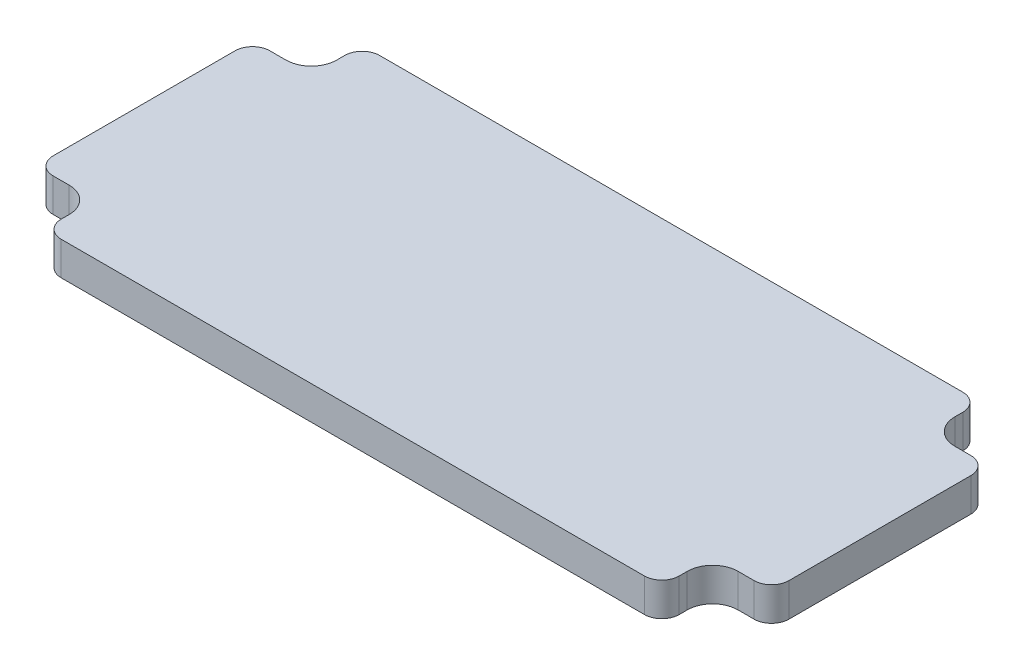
from build123d import *

# Parameters (mm, degrees)
BOSS_EXTRUDE1_DEPTH  = 6.35
MIRROR3_COPY_1_DEPTH = 6.35


with BuildPart() as part:
    # Sketch1 → Boss-Extrude1 (new body)
    with BuildSketch(Plane(origin=(0, 0, 0), x_dir=(1, 0, 0), z_dir=(0, 1, 0))):
        with BuildLine():
            Line((-58.674, 25.4), (-58.674, 26.924))
            ThreePointArc((-58.674, 26.924), (-57.706866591, 29.258866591), (-55.372, 30.226))
            Line((-55.372, 30.226), (0, 30.226))
            Line((0, 30.226), (0, 0))
            Line((0, 0), (-69.85, 0))
            Line((-69.85, 0), (-69.85, 17.272))
            ThreePointArc((-69.85, 17.272), (-68.882866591, 19.606866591), (-66.548, 20.574))
            Line((-66.548, 20.574), (-63.5, 20.574))
            ThreePointArc((-63.5, 20.574), (-60.087502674, 21.987502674), (-58.674, 25.4))
        make_face()
    boss_extrude1 = extrude(amount=BOSS_EXTRUDE1_DEPTH)

    # Mirror1: Boss-Extrude1 across plane
    add(boss_extrude1.mirror(Plane.XY))

    # Mirror3: Boss-Extrude1 across plane
    add(boss_extrude1.mirror(Plane(origin=(0, 0, 0), x_dir=(0, 0, 1), z_dir=(1, 0, 0))))

    # Mirror3 copy 1 sketch → Mirror3 copy 1 (add)
    with BuildSketch(Plane(origin=(0, 0, 0), x_dir=(-1, 0, 0), z_dir=(0, 1, 0))):
        with BuildLine():
            Line((-58.674, 25.4), (-58.674, 26.924))
            ThreePointArc((-58.674, 26.924), (-57.706866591, 29.258866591), (-55.372, 30.226))
            Line((-55.372, 30.226), (0, 30.226))
            Line((0, 30.226), (0, 0))
            Line((0, 0), (-69.85, 0))
            Line((-69.85, 0), (-69.85, 17.272))
            ThreePointArc((-69.85, 17.272), (-68.882866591, 19.606866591), (-66.548, 20.574))
            Line((-66.548, 20.574), (-63.5, 20.574))
            ThreePointArc((-63.5, 20.574), (-60.087502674, 21.987502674), (-58.674, 25.4))
        make_face()
    extrude(amount=MIRROR3_COPY_1_DEPTH)


solid = part.part
